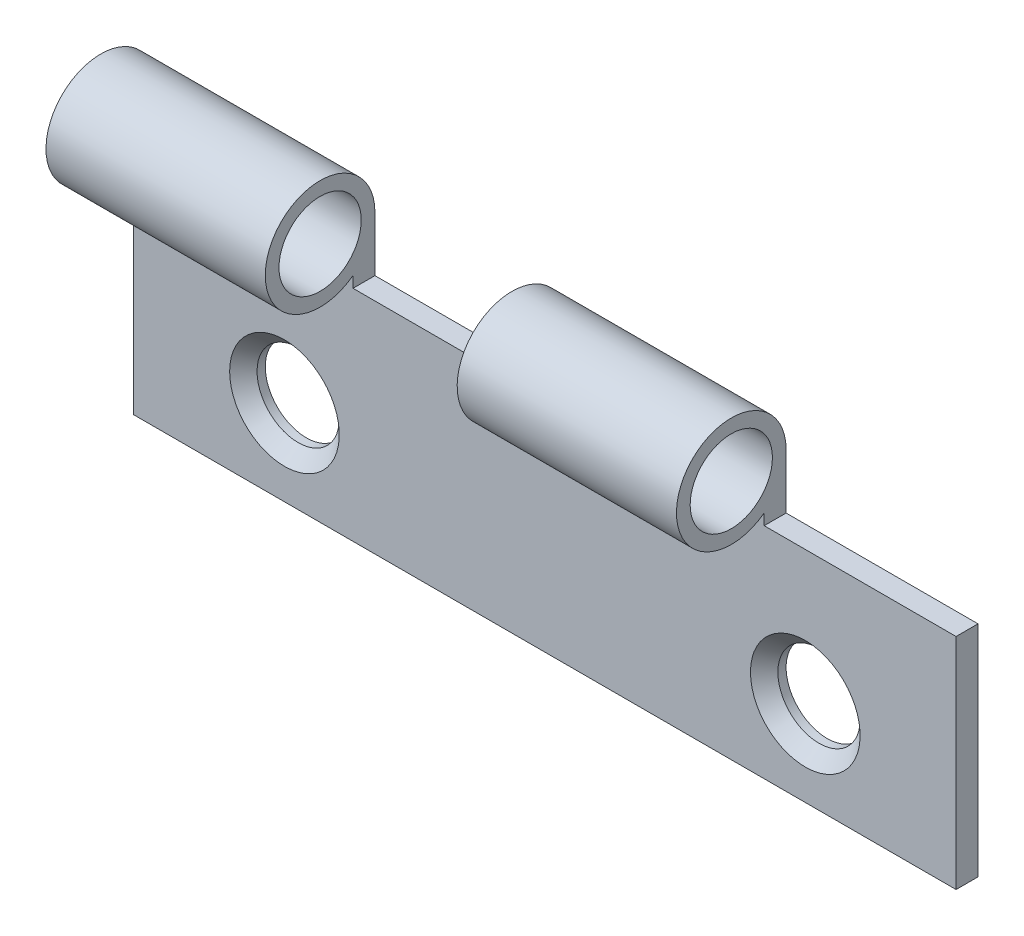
ISO-10303-21;
HEADER;
FILE_DESCRIPTION(('STEP AP214'),'2;1');
FILE_NAME('part.step','',(''),(''),'','','');
FILE_SCHEMA(('AUTOMOTIVE_DESIGN { 1 0 10303 214 1 1 1 1 }'));
ENDSEC;
DATA;
#1=APPLICATION_CONTEXT('core data for automotive mechanical design processes');
#2=APPLICATION_PROTOCOL_DEFINITION('international standard','automotive_design',2000,#1);
#3=PRODUCT_CONTEXT('',#1,'mechanical');
#4=PRODUCT('Part','Part','',(#3));
#5=PRODUCT_RELATED_PRODUCT_CATEGORY('part','',(#4));
#6=PRODUCT_DEFINITION_FORMATION('','',#4);
#7=PRODUCT_DEFINITION_CONTEXT('part definition',#1,'design');
#8=PRODUCT_DEFINITION('design','',#6,#7);
#9=PRODUCT_DEFINITION_SHAPE('','',#8);
#10=(LENGTH_UNIT() NAMED_UNIT(*) SI_UNIT(.MILLI.,.METRE.));
#11=(NAMED_UNIT(*) PLANE_ANGLE_UNIT() SI_UNIT($,.RADIAN.));
#12=(NAMED_UNIT(*) SI_UNIT($,.STERADIAN.) SOLID_ANGLE_UNIT());
#13=UNCERTAINTY_MEASURE_WITH_UNIT(LENGTH_MEASURE(1.E-05),#10,'distance_accuracy_value','');
#14=(GEOMETRIC_REPRESENTATION_CONTEXT(3) GLOBAL_UNCERTAINTY_ASSIGNED_CONTEXT((#13)) GLOBAL_UNIT_ASSIGNED_CONTEXT((#10,
#11,#12)) REPRESENTATION_CONTEXT('',''));
#15=CARTESIAN_POINT('',(0.,0.,0.));
#16=DIRECTION('',(0.,0.,1.));
#17=DIRECTION('',(1.,0.,0.));
#18=AXIS2_PLACEMENT_3D('',#15,#16,#17);
#19=CARTESIAN_POINT('',(0.,10.,2.));
#20=DIRECTION('',(1.,0.,0.));
#21=DIRECTION('',(0.,1.,0.));
#22=AXIS2_PLACEMENT_3D('',#19,#20,#21);
#23=CYLINDRICAL_SURFACE('',#22,2.);
#24=CARTESIAN_POINT('',(15.,10.,2.));
#25=DIRECTION('',(1.,0.,0.));
#26=DIRECTION('',(0.,0.,-1.));
#27=AXIS2_PLACEMENT_3D('',#24,#25,#26);
#28=CIRCLE('',#27,2.);
#29=CARTESIAN_POINT('',(15.,8.4,0.799999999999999));
#30=VERTEX_POINT('',#29);
#31=CARTESIAN_POINT('',(15.,10.,0.));
#32=VERTEX_POINT('',#31);
#33=EDGE_CURVE('E134',#30,#32,#28,.F.);
#34=ORIENTED_EDGE('',*,*,#33,.F.);
#35=DIRECTION('',(1.,0.,0.));
#36=VECTOR('',#35,1.);
#37=CARTESIAN_POINT('',(0.,8.4,0.8));
#38=LINE('',#37,#36);
#39=CARTESIAN_POINT('',(23.,8.4,0.799999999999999));
#40=VERTEX_POINT('',#39);
#41=EDGE_CURVE('E173',#40,#30,#38,.F.);
#42=ORIENTED_EDGE('',*,*,#41,.F.);
#43=CARTESIAN_POINT('',(23.,10.,2.));
#44=DIRECTION('',(-1.,0.,0.));
#45=DIRECTION('',(0.,0.,1.));
#46=AXIS2_PLACEMENT_3D('',#43,#44,#45);
#47=CIRCLE('',#46,2.);
#48=CARTESIAN_POINT('',(23.,10.,0.));
#49=VERTEX_POINT('',#48);
#50=EDGE_CURVE('E152',#49,#40,#47,.F.);
#51=ORIENTED_EDGE('',*,*,#50,.F.);
#52=DIRECTION('',(-1.,0.,0.));
#53=VECTOR('',#52,1.);
#54=CARTESIAN_POINT('',(0.,10.,0.));
#55=LINE('',#54,#53);
#56=EDGE_CURVE('E184',#49,#32,#55,.T.);
#57=ORIENTED_EDGE('',*,*,#56,.T.);
#58=EDGE_LOOP('',(#34,#42,#51,#57));
#59=FACE_BOUND('',#58,.T.);
#60=ADVANCED_FACE('F26',(#59),#23,.T.);
#61=CARTESIAN_POINT('',(0.,10.,2.));
#62=DIRECTION('',(1.,0.,0.));
#63=DIRECTION('',(0.,0.,-1.));
#64=AXIS2_PLACEMENT_3D('',#61,#62,#63);
#65=CYLINDRICAL_SURFACE('',#64,1.5);
#66=CARTESIAN_POINT('',(15.,10.,2.));
#67=DIRECTION('',(1.,0.,0.));
#68=DIRECTION('',(0.,0.,-1.));
#69=AXIS2_PLACEMENT_3D('',#66,#67,#68);
#70=CIRCLE('',#69,1.5);
#71=CARTESIAN_POINT('',(15.,10.,0.5));
#72=VERTEX_POINT('',#71);
#73=EDGE_CURVE('E30',#72,#72,#70,.F.);
#74=ORIENTED_EDGE('',*,*,#73,.T.);
#75=EDGE_LOOP('',(#74));
#76=FACE_BOUND('',#75,.T.);
#77=CARTESIAN_POINT('',(23.,10.,2.));
#78=DIRECTION('',(-1.,0.,0.));
#79=DIRECTION('',(0.,0.,1.));
#80=AXIS2_PLACEMENT_3D('',#77,#78,#79);
#81=CIRCLE('',#80,1.5);
#82=CARTESIAN_POINT('',(23.,10.,3.5));
#83=VERTEX_POINT('',#82);
#84=EDGE_CURVE('E149',#83,#83,#81,.F.);
#85=ORIENTED_EDGE('',*,*,#84,.T.);
#86=EDGE_LOOP('',(#85));
#87=FACE_BOUND('',#86,.T.);
#88=ADVANCED_FACE('F225',(#76,#87),#65,.F.);
#89=CARTESIAN_POINT('',(0.,0.,0.8));
#90=DIRECTION('',(1.,0.,0.));
#91=DIRECTION('',(0.,0.,-1.));
#92=AXIS2_PLACEMENT_3D('',#89,#90,#91);
#93=PLANE('',#92);
#94=CARTESIAN_POINT('',(0.,10.,2.));
#95=DIRECTION('',(1.,0.,0.));
#96=DIRECTION('',(0.,0.,-1.));
#97=AXIS2_PLACEMENT_3D('',#94,#95,#96);
#98=CIRCLE('',#97,1.5);
#99=CARTESIAN_POINT('',(0.,10.,0.5));
#100=VERTEX_POINT('',#99);
#101=EDGE_CURVE('E166',#100,#100,#98,.T.);
#102=ORIENTED_EDGE('',*,*,#101,.T.);
#103=EDGE_LOOP('',(#102));
#104=FACE_BOUND('',#103,.T.);
#105=DIRECTION('',(0.,-1.,0.));
#106=VECTOR('',#105,1.);
#107=CARTESIAN_POINT('',(0.,0.,0.8));
#108=LINE('',#107,#106);
#109=CARTESIAN_POINT('',(0.,8.4,0.8));
#110=VERTEX_POINT('',#109);
#111=CARTESIAN_POINT('',(0.,0.,0.8));
#112=VERTEX_POINT('',#111);
#113=EDGE_CURVE('E187',#110,#112,#108,.T.);
#114=ORIENTED_EDGE('',*,*,#113,.F.);
#115=CARTESIAN_POINT('',(0.,10.,2.));
#116=DIRECTION('',(1.,0.,0.));
#117=DIRECTION('',(0.,0.,-1.));
#118=AXIS2_PLACEMENT_3D('',#115,#116,#117);
#119=CIRCLE('',#118,2.);
#120=CARTESIAN_POINT('',(0.,10.,0.));
#121=VERTEX_POINT('',#120);
#122=EDGE_CURVE('E169',#121,#110,#119,.T.);
#123=ORIENTED_EDGE('',*,*,#122,.F.);
#124=DIRECTION('',(0.,-1.,0.));
#125=VECTOR('',#124,1.);
#126=CARTESIAN_POINT('',(0.,0.,0.));
#127=LINE('',#126,#125);
#128=CARTESIAN_POINT('',(0.,0.,0.));
#129=VERTEX_POINT('',#128);
#130=EDGE_CURVE('E176',#121,#129,#127,.T.);
#131=ORIENTED_EDGE('',*,*,#130,.T.);
#132=DIRECTION('',(0.,0.,-1.));
#133=VECTOR('',#132,1.);
#134=CARTESIAN_POINT('',(0.,0.,0.8));
#135=LINE('',#134,#133);
#136=EDGE_CURVE('E197',#112,#129,#135,.T.);
#137=ORIENTED_EDGE('',*,*,#136,.F.);
#138=EDGE_LOOP('',(#114,#123,#131,#137));
#139=FACE_BOUND('',#138,.T.);
#140=ADVANCED_FACE('F28',(#104,#139),#93,.F.);
#141=CARTESIAN_POINT('',(0.,0.,0.8));
#142=DIRECTION('',(0.,1.,0.));
#143=DIRECTION('',(0.,0.,1.));
#144=AXIS2_PLACEMENT_3D('',#141,#142,#143);
#145=PLANE('',#144);
#146=DIRECTION('',(1.,0.,0.));
#147=VECTOR('',#146,1.);
#148=CARTESIAN_POINT('',(0.,0.,0.));
#149=LINE('',#148,#147);
#150=CARTESIAN_POINT('',(30.,0.,0.));
#151=VERTEX_POINT('',#150);
#152=EDGE_CURVE('E179',#129,#151,#149,.T.);
#153=ORIENTED_EDGE('',*,*,#152,.T.);
#154=DIRECTION('',(0.,0.,-1.));
#155=VECTOR('',#154,1.);
#156=CARTESIAN_POINT('',(30.,0.,0.8));
#157=LINE('',#156,#155);
#158=CARTESIAN_POINT('',(30.,0.,0.8));
#159=VERTEX_POINT('',#158);
#160=EDGE_CURVE('E194',#159,#151,#157,.T.);
#161=ORIENTED_EDGE('',*,*,#160,.F.);
#162=DIRECTION('',(1.,0.,0.));
#163=VECTOR('',#162,1.);
#164=CARTESIAN_POINT('',(0.,0.,0.8));
#165=LINE('',#164,#163);
#166=EDGE_CURVE('E189',#112,#159,#165,.T.);
#167=ORIENTED_EDGE('',*,*,#166,.F.);
#168=ORIENTED_EDGE('',*,*,#136,.T.);
#169=EDGE_LOOP('',(#153,#161,#167,#168));
#170=FACE_BOUND('',#169,.T.);
#171=ADVANCED_FACE('F252',(#170),#145,.F.);
#172=CARTESIAN_POINT('',(30.,0.,0.8));
#173=DIRECTION('',(-1.,0.,0.));
#174=DIRECTION('',(0.,0.,1.));
#175=AXIS2_PLACEMENT_3D('',#172,#173,#174);
#176=PLANE('',#175);
#177=DIRECTION('',(0.,1.,0.));
#178=VECTOR('',#177,1.);
#179=CARTESIAN_POINT('',(30.,0.,0.));
#180=LINE('',#179,#178);
#181=CARTESIAN_POINT('',(30.,7.99526411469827,0.));
#182=VERTEX_POINT('',#181);
#183=EDGE_CURVE('E181',#151,#182,#180,.T.);
#184=ORIENTED_EDGE('',*,*,#183,.T.);
#185=DIRECTION('',(0.,0.,1.));
#186=VECTOR('',#185,1.);
#187=CARTESIAN_POINT('',(30.,7.99526411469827,0.));
#188=LINE('',#187,#186);
#189=CARTESIAN_POINT('',(30.,7.99526411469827,0.8));
#190=VERTEX_POINT('',#189);
#191=EDGE_CURVE('E146',#182,#190,#188,.T.);
#192=ORIENTED_EDGE('',*,*,#191,.T.);
#193=DIRECTION('',(0.,1.,0.));
#194=VECTOR('',#193,1.);
#195=CARTESIAN_POINT('',(30.,0.,0.8));
#196=LINE('',#195,#194);
#197=EDGE_CURVE('E191',#159,#190,#196,.T.);
#198=ORIENTED_EDGE('',*,*,#197,.F.);
#199=ORIENTED_EDGE('',*,*,#160,.T.);
#200=EDGE_LOOP('',(#184,#192,#198,#199));
#201=FACE_BOUND('',#200,.T.);
#202=ADVANCED_FACE('F256',(#201),#176,.F.);
#203=CARTESIAN_POINT('',(0.,0.,0.8));
#204=DIRECTION('',(0.,0.,-1.));
#205=DIRECTION('',(-1.,0.,0.));
#206=AXIS2_PLACEMENT_3D('',#203,#204,#205);
#207=PLANE('',#206);
#208=CARTESIAN_POINT('',(5.5,3.11966084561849,0.8));
#209=DIRECTION('',(0.,0.,-1.));
#210=DIRECTION('',(-1.,0.,0.));
#211=AXIS2_PLACEMENT_3D('',#208,#209,#210);
#212=CIRCLE('',#211,2.);
#213=CARTESIAN_POINT('',(3.5,3.11966084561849,0.8));
#214=VERTEX_POINT('',#213);
#215=EDGE_CURVE('E35',#214,#214,#212,.T.);
#216=ORIENTED_EDGE('',*,*,#215,.T.);
#217=EDGE_LOOP('',(#216));
#218=FACE_BOUND('',#217,.T.);
#219=CARTESIAN_POINT('',(24.5,3.11966084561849,0.8));
#220=DIRECTION('',(0.,0.,-1.));
#221=DIRECTION('',(-1.,0.,0.));
#222=AXIS2_PLACEMENT_3D('',#219,#220,#221);
#223=CIRCLE('',#222,2.00000000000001);
#224=CARTESIAN_POINT('',(22.5,3.11966084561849,0.8));
#225=VERTEX_POINT('',#224);
#226=EDGE_CURVE('E203',#225,#225,#223,.T.);
#227=ORIENTED_EDGE('',*,*,#226,.T.);
#228=EDGE_LOOP('',(#227));
#229=FACE_BOUND('',#228,.T.);
#230=ORIENTED_EDGE('',*,*,#41,.T.);
#231=DIRECTION('',(0.,-1.,0.));
#232=VECTOR('',#231,1.);
#233=CARTESIAN_POINT('',(15.,0.,0.8));
#234=LINE('',#233,#232);
#235=CARTESIAN_POINT('',(15.,7.99526411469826,0.8));
#236=VERTEX_POINT('',#235);
#237=EDGE_CURVE('E136',#30,#236,#234,.T.);
#238=ORIENTED_EDGE('',*,*,#237,.T.);
#239=DIRECTION('',(-1.,0.,0.));
#240=VECTOR('',#239,1.);
#241=CARTESIAN_POINT('',(0.,7.99526411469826,0.8));
#242=LINE('',#241,#240);
#243=CARTESIAN_POINT('',(8.,7.99526411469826,0.8));
#244=VERTEX_POINT('',#243);
#245=EDGE_CURVE('E139',#236,#244,#242,.T.);
#246=ORIENTED_EDGE('',*,*,#245,.T.);
#247=DIRECTION('',(0.,1.,0.));
#248=VECTOR('',#247,1.);
#249=CARTESIAN_POINT('',(8.,0.,0.8));
#250=LINE('',#249,#248);
#251=CARTESIAN_POINT('',(8.,8.4,0.8));
#252=VERTEX_POINT('',#251);
#253=EDGE_CURVE('E107',#244,#252,#250,.T.);
#254=ORIENTED_EDGE('',*,*,#253,.T.);
#255=EDGE_CURVE('E172',#252,#110,#38,.F.);
#256=ORIENTED_EDGE('',*,*,#255,.T.);
#257=ORIENTED_EDGE('',*,*,#113,.T.);
#258=ORIENTED_EDGE('',*,*,#166,.T.);
#259=ORIENTED_EDGE('',*,*,#197,.T.);
#260=DIRECTION('',(-1.,0.,0.));
#261=VECTOR('',#260,1.);
#262=CARTESIAN_POINT('',(0.,7.99526411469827,0.8));
#263=LINE('',#262,#261);
#264=CARTESIAN_POINT('',(23.,7.99526411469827,0.8));
#265=VERTEX_POINT('',#264);
#266=EDGE_CURVE('E157',#190,#265,#263,.T.);
#267=ORIENTED_EDGE('',*,*,#266,.T.);
#268=DIRECTION('',(0.,1.,0.));
#269=VECTOR('',#268,1.);
#270=CARTESIAN_POINT('',(23.,0.,0.8));
#271=LINE('',#270,#269);
#272=EDGE_CURVE('E154',#265,#40,#271,.T.);
#273=ORIENTED_EDGE('',*,*,#272,.T.);
#274=EDGE_LOOP('',(#230,#238,#246,#254,#256,#257,#258,#259,#267,#273));
#275=FACE_BOUND('',#274,.T.);
#276=ADVANCED_FACE('F243',(#218,#229,#275),#207,.F.);
#277=CARTESIAN_POINT('',(0.,0.,0.));
#278=DIRECTION('',(0.,0.,-1.));
#279=DIRECTION('',(-1.,0.,0.));
#280=AXIS2_PLACEMENT_3D('',#277,#278,#279);
#281=PLANE('',#280);
#282=DIRECTION('',(0.,1.,0.));
#283=VECTOR('',#282,1.);
#284=CARTESIAN_POINT('',(15.,7.99526411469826,0.));
#285=LINE('',#284,#283);
#286=CARTESIAN_POINT('',(15.,7.99526411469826,0.));
#287=VERTEX_POINT('',#286);
#288=EDGE_CURVE('E125',#287,#32,#285,.T.);
#289=ORIENTED_EDGE('',*,*,#288,.T.);
#290=ORIENTED_EDGE('',*,*,#56,.F.);
#291=DIRECTION('',(0.,-1.,0.));
#292=VECTOR('',#291,1.);
#293=CARTESIAN_POINT('',(23.,17.0048633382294,0.));
#294=LINE('',#293,#292);
#295=CARTESIAN_POINT('',(23.,7.99526411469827,0.));
#296=VERTEX_POINT('',#295);
#297=EDGE_CURVE('E51',#49,#296,#294,.T.);
#298=ORIENTED_EDGE('',*,*,#297,.T.);
#299=DIRECTION('',(1.,0.,0.));
#300=VECTOR('',#299,1.);
#301=CARTESIAN_POINT('',(30.,7.99526411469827,0.));
#302=LINE('',#301,#300);
#303=EDGE_CURVE('E142',#296,#182,#302,.T.);
#304=ORIENTED_EDGE('',*,*,#303,.T.);
#305=ORIENTED_EDGE('',*,*,#183,.F.);
#306=ORIENTED_EDGE('',*,*,#152,.F.);
#307=ORIENTED_EDGE('',*,*,#130,.F.);
#308=CARTESIAN_POINT('',(8.,10.,0.));
#309=VERTEX_POINT('',#308);
#310=EDGE_CURVE('E124',#309,#121,#55,.T.);
#311=ORIENTED_EDGE('',*,*,#310,.F.);
#312=DIRECTION('',(0.,-1.,0.));
#313=VECTOR('',#312,1.);
#314=CARTESIAN_POINT('',(8.,7.99526411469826,0.));
#315=LINE('',#314,#313);
#316=CARTESIAN_POINT('',(8.,7.99526411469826,0.));
#317=VERTEX_POINT('',#316);
#318=EDGE_CURVE('E43',#309,#317,#315,.T.);
#319=ORIENTED_EDGE('',*,*,#318,.T.);
#320=DIRECTION('',(1.,0.,0.));
#321=VECTOR('',#320,1.);
#322=CARTESIAN_POINT('',(15.,7.99526411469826,0.));
#323=LINE('',#322,#321);
#324=EDGE_CURVE('E111',#317,#287,#323,.T.);
#325=ORIENTED_EDGE('',*,*,#324,.T.);
#326=EDGE_LOOP('',(#289,#290,#298,#304,#305,#306,#307,#311,#319,#325));
#327=FACE_BOUND('',#326,.T.);
#328=CARTESIAN_POINT('',(5.5,3.11966084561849,0.));
#329=DIRECTION('',(0.,0.,1.));
#330=DIRECTION('',(1.,0.,0.));
#331=AXIS2_PLACEMENT_3D('',#328,#329,#330);
#332=CIRCLE('',#331,1.5);
#333=CARTESIAN_POINT('',(7.,3.11966084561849,0.));
#334=VERTEX_POINT('',#333);
#335=EDGE_CURVE('E160',#334,#334,#332,.T.);
#336=ORIENTED_EDGE('',*,*,#335,.T.);
#337=EDGE_LOOP('',(#336));
#338=FACE_BOUND('',#337,.T.);
#339=CARTESIAN_POINT('',(24.5,3.11966084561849,0.));
#340=DIRECTION('',(0.,0.,1.));
#341=DIRECTION('',(1.,0.,0.));
#342=AXIS2_PLACEMENT_3D('',#339,#340,#341);
#343=CIRCLE('',#342,1.5);
#344=CARTESIAN_POINT('',(26.,3.11966084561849,0.));
#345=VERTEX_POINT('',#344);
#346=EDGE_CURVE('E163',#345,#345,#343,.T.);
#347=ORIENTED_EDGE('',*,*,#346,.T.);
#348=EDGE_LOOP('',(#347));
#349=FACE_BOUND('',#348,.T.);
#350=ADVANCED_FACE('F121',(#327,#338,#349),#281,.T.);
#351=ORIENTED_EDGE('',*,*,#255,.F.);
#352=CARTESIAN_POINT('',(8.,10.,2.));
#353=DIRECTION('',(-1.,0.,0.));
#354=DIRECTION('',(0.,0.,1.));
#355=AXIS2_PLACEMENT_3D('',#352,#353,#354);
#356=CIRCLE('',#355,2.);
#357=EDGE_CURVE('E131',#309,#252,#356,.F.);
#358=ORIENTED_EDGE('',*,*,#357,.F.);
#359=ORIENTED_EDGE('',*,*,#310,.T.);
#360=ORIENTED_EDGE('',*,*,#122,.T.);
#361=EDGE_LOOP('',(#351,#358,#359,#360));
#362=FACE_BOUND('',#361,.T.);
#363=ADVANCED_FACE('F228',(#362),#23,.T.);
#364=CARTESIAN_POINT('',(8.,10.,2.));
#365=DIRECTION('',(-1.,0.,0.));
#366=DIRECTION('',(0.,0.,1.));
#367=AXIS2_PLACEMENT_3D('',#364,#365,#366);
#368=CIRCLE('',#367,1.5);
#369=CARTESIAN_POINT('',(8.,10.,3.5));
#370=VERTEX_POINT('',#369);
#371=EDGE_CURVE('E129',#370,#370,#368,.F.);
#372=ORIENTED_EDGE('',*,*,#371,.T.);
#373=EDGE_LOOP('',(#372));
#374=FACE_BOUND('',#373,.T.);
#375=ORIENTED_EDGE('',*,*,#101,.F.);
#376=EDGE_LOOP('',(#375));
#377=FACE_BOUND('',#376,.T.);
#378=ADVANCED_FACE('F212',(#374,#377),#65,.F.);
#379=CARTESIAN_POINT('',(24.5,3.11966084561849,0.));
#380=DIRECTION('',(0.,0.,1.));
#381=DIRECTION('',(1.,0.,0.));
#382=AXIS2_PLACEMENT_3D('',#379,#380,#381);
#383=CYLINDRICAL_SURFACE('',#382,1.5);
#384=CARTESIAN_POINT('',(24.5,3.11966084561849,0.299999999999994));
#385=DIRECTION('',(0.,0.,-1.));
#386=DIRECTION('',(-1.,0.,0.));
#387=AXIS2_PLACEMENT_3D('',#384,#385,#386);
#388=CIRCLE('',#387,1.5);
#389=CARTESIAN_POINT('',(23.,3.11966084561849,0.299999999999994));
#390=VERTEX_POINT('',#389);
#391=EDGE_CURVE('E11',#390,#390,#388,.F.);
#392=ORIENTED_EDGE('',*,*,#391,.T.);
#393=EDGE_LOOP('',(#392));
#394=FACE_BOUND('',#393,.T.);
#395=ORIENTED_EDGE('',*,*,#346,.F.);
#396=EDGE_LOOP('',(#395));
#397=FACE_BOUND('',#396,.T.);
#398=ADVANCED_FACE('F242',(#394,#397),#383,.F.);
#399=CARTESIAN_POINT('',(5.5,3.11966084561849,0.));
#400=DIRECTION('',(0.,0.,1.));
#401=DIRECTION('',(1.,0.,0.));
#402=AXIS2_PLACEMENT_3D('',#399,#400,#401);
#403=CYLINDRICAL_SURFACE('',#402,1.5);
#404=CARTESIAN_POINT('',(5.5,3.11966084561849,0.300000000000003));
#405=DIRECTION('',(0.,0.,-1.));
#406=DIRECTION('',(-1.,0.,0.));
#407=AXIS2_PLACEMENT_3D('',#404,#405,#406);
#408=CIRCLE('',#407,1.5);
#409=CARTESIAN_POINT('',(4.,3.11966084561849,0.300000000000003));
#410=VERTEX_POINT('',#409);
#411=EDGE_CURVE('E200',#410,#410,#408,.F.);
#412=ORIENTED_EDGE('',*,*,#411,.T.);
#413=EDGE_LOOP('',(#412));
#414=FACE_BOUND('',#413,.T.);
#415=ORIENTED_EDGE('',*,*,#335,.F.);
#416=EDGE_LOOP('',(#415));
#417=FACE_BOUND('',#416,.T.);
#418=ADVANCED_FACE('F282',(#414,#417),#403,.F.);
#419=CARTESIAN_POINT('',(5.5,3.11966084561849,0.300000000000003));
#420=DIRECTION('',(0.,0.,1.));
#421=DIRECTION('',(1.,0.,0.));
#422=AXIS2_PLACEMENT_3D('',#419,#420,#421);
#423=CONICAL_SURFACE('',#422,1.5,0.78539816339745);
#424=ORIENTED_EDGE('',*,*,#215,.F.);
#425=EDGE_LOOP('',(#424));
#426=FACE_BOUND('',#425,.T.);
#427=ORIENTED_EDGE('',*,*,#411,.F.);
#428=EDGE_LOOP('',(#427));
#429=FACE_BOUND('',#428,.T.);
#430=ADVANCED_FACE('F278',(#426,#429),#423,.F.);
#431=CARTESIAN_POINT('',(24.5,3.11966084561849,0.299999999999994));
#432=DIRECTION('',(0.,0.,1.));
#433=DIRECTION('',(1.,0.,0.));
#434=AXIS2_PLACEMENT_3D('',#431,#432,#433);
#435=CONICAL_SURFACE('',#434,1.5,0.785398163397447);
#436=ORIENTED_EDGE('',*,*,#226,.F.);
#437=EDGE_LOOP('',(#436));
#438=FACE_BOUND('',#437,.T.);
#439=ORIENTED_EDGE('',*,*,#391,.F.);
#440=EDGE_LOOP('',(#439));
#441=FACE_BOUND('',#440,.T.);
#442=ADVANCED_FACE('F273',(#438,#441),#435,.F.);
#443=CARTESIAN_POINT('',(30.,7.99526411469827,0.));
#444=DIRECTION('',(0.,-1.,0.));
#445=DIRECTION('',(0.,0.,-1.));
#446=AXIS2_PLACEMENT_3D('',#443,#444,#445);
#447=PLANE('',#446);
#448=ORIENTED_EDGE('',*,*,#191,.F.);
#449=ORIENTED_EDGE('',*,*,#303,.F.);
#450=DIRECTION('',(0.,0.,1.));
#451=VECTOR('',#450,1.);
#452=CARTESIAN_POINT('',(23.,7.99526411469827,0.));
#453=LINE('',#452,#451);
#454=EDGE_CURVE('E145',#296,#265,#453,.T.);
#455=ORIENTED_EDGE('',*,*,#454,.T.);
#456=ORIENTED_EDGE('',*,*,#266,.F.);
#457=EDGE_LOOP('',(#448,#449,#455,#456));
#458=FACE_BOUND('',#457,.T.);
#459=ADVANCED_FACE('F260',(#458),#447,.F.);
#460=CARTESIAN_POINT('',(23.,17.0048633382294,0.));
#461=DIRECTION('',(-1.,0.,0.));
#462=DIRECTION('',(0.,0.,1.));
#463=AXIS2_PLACEMENT_3D('',#460,#461,#462);
#464=PLANE('',#463);
#465=ORIENTED_EDGE('',*,*,#84,.F.);
#466=EDGE_LOOP('',(#465));
#467=FACE_BOUND('',#466,.T.);
#468=ORIENTED_EDGE('',*,*,#454,.F.);
#469=ORIENTED_EDGE('',*,*,#297,.F.);
#470=ORIENTED_EDGE('',*,*,#50,.T.);
#471=ORIENTED_EDGE('',*,*,#272,.F.);
#472=EDGE_LOOP('',(#468,#469,#470,#471));
#473=FACE_BOUND('',#472,.T.);
#474=ADVANCED_FACE('F264',(#467,#473),#464,.F.);
#475=CARTESIAN_POINT('',(15.,7.99526411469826,0.));
#476=DIRECTION('',(0.,-1.,0.));
#477=DIRECTION('',(0.,0.,-1.));
#478=AXIS2_PLACEMENT_3D('',#475,#476,#477);
#479=PLANE('',#478);
#480=DIRECTION('',(0.,0.,1.));
#481=VECTOR('',#480,1.);
#482=CARTESIAN_POINT('',(15.,7.99526411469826,0.));
#483=LINE('',#482,#481);
#484=EDGE_CURVE('E110',#287,#236,#483,.T.);
#485=ORIENTED_EDGE('',*,*,#484,.F.);
#486=ORIENTED_EDGE('',*,*,#324,.F.);
#487=DIRECTION('',(0.,0.,1.));
#488=VECTOR('',#487,1.);
#489=CARTESIAN_POINT('',(8.,7.99526411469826,0.));
#490=LINE('',#489,#488);
#491=EDGE_CURVE('E103',#317,#244,#490,.T.);
#492=ORIENTED_EDGE('',*,*,#491,.T.);
#493=ORIENTED_EDGE('',*,*,#245,.F.);
#494=EDGE_LOOP('',(#485,#486,#492,#493));
#495=FACE_BOUND('',#494,.T.);
#496=ADVANCED_FACE('F114',(#495),#479,.F.);
#497=CARTESIAN_POINT('',(15.,7.99526411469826,0.));
#498=DIRECTION('',(1.,0.,0.));
#499=DIRECTION('',(0.,0.,-1.));
#500=AXIS2_PLACEMENT_3D('',#497,#498,#499);
#501=PLANE('',#500);
#502=ORIENTED_EDGE('',*,*,#73,.F.);
#503=EDGE_LOOP('',(#502));
#504=FACE_BOUND('',#503,.T.);
#505=ORIENTED_EDGE('',*,*,#237,.F.);
#506=ORIENTED_EDGE('',*,*,#33,.T.);
#507=ORIENTED_EDGE('',*,*,#288,.F.);
#508=ORIENTED_EDGE('',*,*,#484,.T.);
#509=EDGE_LOOP('',(#505,#506,#507,#508));
#510=FACE_BOUND('',#509,.T.);
#511=ADVANCED_FACE('F216',(#504,#510),#501,.F.);
#512=CARTESIAN_POINT('',(8.,7.99526411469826,0.));
#513=DIRECTION('',(-1.,0.,0.));
#514=DIRECTION('',(0.,0.,1.));
#515=AXIS2_PLACEMENT_3D('',#512,#513,#514);
#516=PLANE('',#515);
#517=ORIENTED_EDGE('',*,*,#371,.F.);
#518=EDGE_LOOP('',(#517));
#519=FACE_BOUND('',#518,.T.);
#520=ORIENTED_EDGE('',*,*,#491,.F.);
#521=ORIENTED_EDGE('',*,*,#318,.F.);
#522=ORIENTED_EDGE('',*,*,#357,.T.);
#523=ORIENTED_EDGE('',*,*,#253,.F.);
#524=EDGE_LOOP('',(#520,#521,#522,#523));
#525=FACE_BOUND('',#524,.T.);
#526=ADVANCED_FACE('F105',(#519,#525),#516,.F.);
#527=CLOSED_SHELL('',(#60,#88,#140,#171,#202,#276,#350,#363,#378,#398,#418,#430,#442,#459,#474,
#496,#511,#526));
#528=MANIFOLD_SOLID_BREP('B2',#527);
#529=ADVANCED_BREP_SHAPE_REPRESENTATION('',(#18,#528),#14);
#530=SHAPE_DEFINITION_REPRESENTATION(#9,#529);
ENDSEC;
END-ISO-10303-21;
